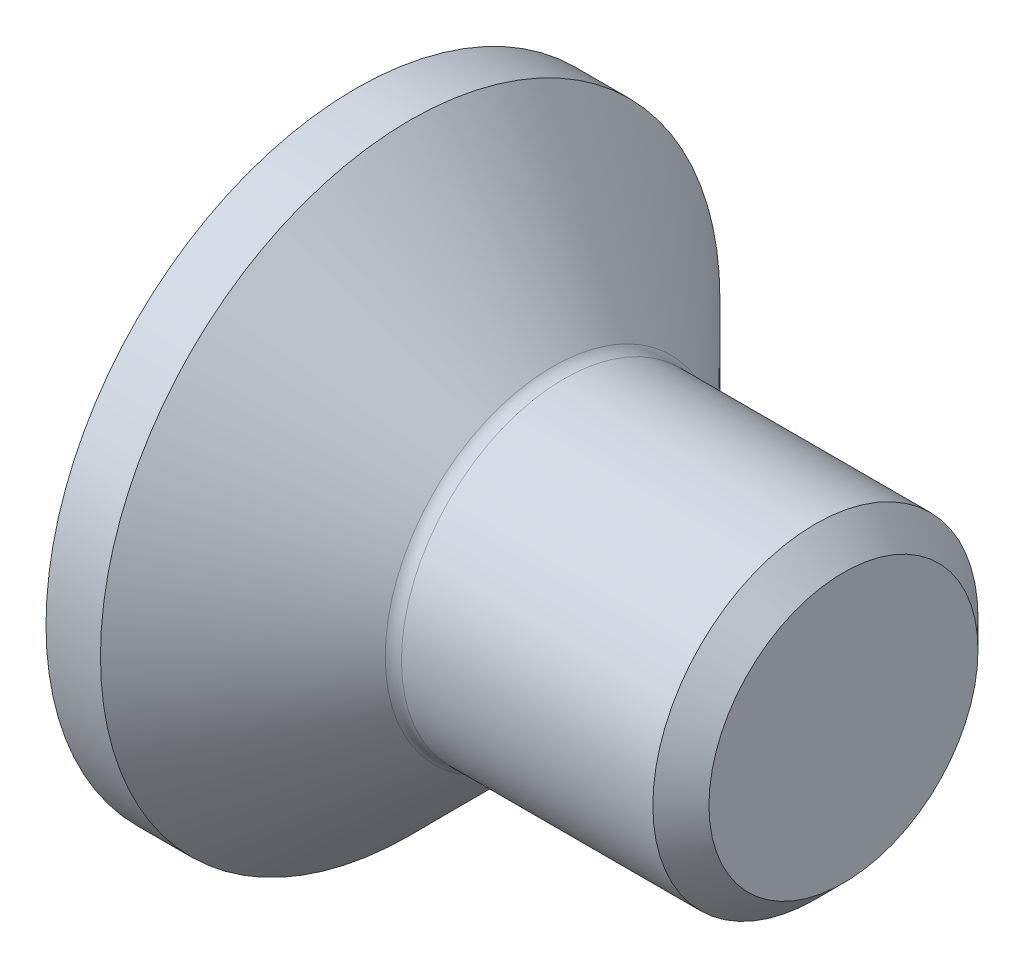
from build123d import *

# Parameters (mm, degrees)
FILLET1_R   = 0.4
HEX_2_DEPTH = 3


with BuildPart() as part:
    # BodySke → BaseBody (revolve)
    with BuildSketch(Plane.XY, mode=Mode.PRIVATE) as basebody_sk:
        Polygon((0, 0), (0, 7.62), (1.34, 7.62), (4.96, 4), (11.3095, 4), (12, 3.3095), (12, 0), align=None)
    revolve(basebody_sk.sketch.rotate(Axis((0, 0, 0), (1, 0, 0)), 90), axis=Axis((0, 0, 0), (1, 0, 0)))

    # Fillet1
    fillet1_edges = [part.edges().sort_by_distance(p)[0] for p in [
        (4.96, 0, -4),
    ]]
    fillet(fillet1_edges, radius=FILLET1_R)

    # Sketch2 → PreBroach (revolve, cut)
    with BuildSketch(Plane.XY, mode=Mode.PRIVATE) as prebroach_sk:
        Polygon((0, 2.5), (3, 2.5), (4.443375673, 0), (0, 0), align=None)
    revolve(prebroach_sk.sketch.rotate(Axis((0, 0, 0), (1, 0, 0)), 90), axis=Axis((0, 0, 0), (1, 0, 0)), mode=Mode.SUBTRACT)

    # Sketch3 → Hex 2 (cut)
    with BuildSketch(Plane.ZY):
        Polygon((-2.5, -1.443375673), (-2.5, 1.443375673), (0, 2.886751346), (2.5, 1.443375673), (2.5, -1.443375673), (0, -2.886751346), align=None)
    extrude(amount=-HEX_2_DEPTH, mode=Mode.SUBTRACT)


solid = part.part
